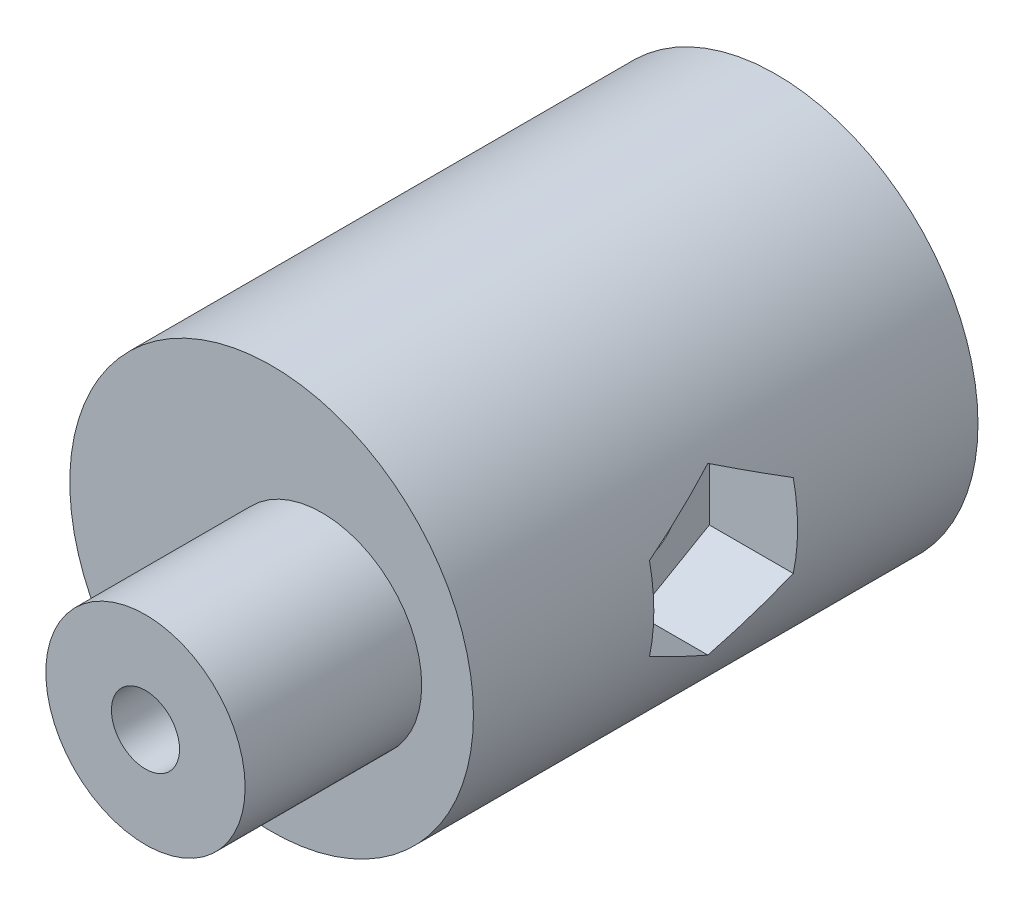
ISO-10303-21;
HEADER;
FILE_DESCRIPTION(('STEP AP214'),'2;1');
FILE_NAME('part.step','',(''),(''),'','','');
FILE_SCHEMA(('AUTOMOTIVE_DESIGN { 1 0 10303 214 1 1 1 1 }'));
ENDSEC;
DATA;
#1=APPLICATION_CONTEXT('core data for automotive mechanical design processes');
#2=APPLICATION_PROTOCOL_DEFINITION('international standard','automotive_design',2000,#1);
#3=PRODUCT_CONTEXT('',#1,'mechanical');
#4=PRODUCT('Part','Part','',(#3));
#5=PRODUCT_RELATED_PRODUCT_CATEGORY('part','',(#4));
#6=PRODUCT_DEFINITION_FORMATION('','',#4);
#7=PRODUCT_DEFINITION_CONTEXT('part definition',#1,'design');
#8=PRODUCT_DEFINITION('design','',#6,#7);
#9=PRODUCT_DEFINITION_SHAPE('','',#8);
#10=(LENGTH_UNIT() NAMED_UNIT(*) SI_UNIT(.MILLI.,.METRE.));
#11=(NAMED_UNIT(*) PLANE_ANGLE_UNIT() SI_UNIT($,.RADIAN.));
#12=(NAMED_UNIT(*) SI_UNIT($,.STERADIAN.) SOLID_ANGLE_UNIT());
#13=UNCERTAINTY_MEASURE_WITH_UNIT(LENGTH_MEASURE(1.E-05),#10,'distance_accuracy_value','');
#14=(GEOMETRIC_REPRESENTATION_CONTEXT(3) GLOBAL_UNCERTAINTY_ASSIGNED_CONTEXT((#13)) GLOBAL_UNIT_ASSIGNED_CONTEXT((#10,
#11,#12)) REPRESENTATION_CONTEXT('',''));
#15=CARTESIAN_POINT('',(0.,0.,0.));
#16=DIRECTION('',(0.,0.,1.));
#17=DIRECTION('',(1.,0.,0.));
#18=AXIS2_PLACEMENT_3D('',#15,#16,#17);
#19=CARTESIAN_POINT('',(2.,0.,21.));
#20=DIRECTION('',(0.,0.,1.));
#21=DIRECTION('',(1.,0.,0.));
#22=AXIS2_PLACEMENT_3D('',#19,#20,#21);
#23=PLANE('',#22);
#24=CARTESIAN_POINT('',(2.,0.,21.));
#25=DIRECTION('',(0.,0.,1.));
#26=DIRECTION('',(1.,0.,0.));
#27=AXIS2_PLACEMENT_3D('',#24,#25,#26);
#28=CIRCLE('',#27,1.35);
#29=CARTESIAN_POINT('',(3.35,0.,21.));
#30=VERTEX_POINT('',#29);
#31=EDGE_CURVE('E10',#30,#30,#28,.T.);
#32=ORIENTED_EDGE('',*,*,#31,.T.);
#33=EDGE_LOOP('',(#32));
#34=FACE_BOUND('',#33,.T.);
#35=ADVANCED_FACE('F16',(#34),#23,.T.);
#36=CARTESIAN_POINT('',(2.,0.,21.));
#37=DIRECTION('',(0.,0.,-1.));
#38=DIRECTION('',(1.,0.,0.));
#39=AXIS2_PLACEMENT_3D('',#36,#37,#38);
#40=CYLINDRICAL_SURFACE('',#39,1.35);
#41=CARTESIAN_POINT('',(2.,0.,27.));
#42=DIRECTION('',(0.,0.,1.));
#43=DIRECTION('',(1.,0.,0.));
#44=AXIS2_PLACEMENT_3D('',#41,#42,#43);
#45=CIRCLE('',#44,1.35);
#46=CARTESIAN_POINT('',(3.35,0.,27.));
#47=VERTEX_POINT('',#46);
#48=EDGE_CURVE('E30',#47,#47,#45,.T.);
#49=ORIENTED_EDGE('',*,*,#48,.T.);
#50=EDGE_LOOP('',(#49));
#51=FACE_BOUND('',#50,.T.);
#52=ORIENTED_EDGE('',*,*,#31,.F.);
#53=EDGE_LOOP('',(#52));
#54=FACE_BOUND('',#53,.T.);
#55=ADVANCED_FACE('F202',(#51,#54),#40,.F.);
#56=CARTESIAN_POINT('',(0.,0.,17.));
#57=DIRECTION('',(0.,0.,1.));
#58=DIRECTION('',(1.,0.,0.));
#59=AXIS2_PLACEMENT_3D('',#56,#57,#58);
#60=PLANE('',#59);
#61=CARTESIAN_POINT('',(0.,0.,17.));
#62=DIRECTION('',(0.,0.,1.));
#63=DIRECTION('',(1.,0.,0.));
#64=AXIS2_PLACEMENT_3D('',#61,#62,#63);
#65=CIRCLE('',#64,2.6);
#66=CARTESIAN_POINT('',(2.6,0.,17.));
#67=VERTEX_POINT('',#66);
#68=EDGE_CURVE('E157',#67,#67,#65,.T.);
#69=ORIENTED_EDGE('',*,*,#68,.F.);
#70=EDGE_LOOP('',(#69));
#71=FACE_BOUND('',#70,.T.);
#72=ADVANCED_FACE('F200',(#71),#60,.F.);
#73=CARTESIAN_POINT('',(2.,0.,27.));
#74=DIRECTION('',(0.,0.,1.));
#75=DIRECTION('',(1.,0.,0.));
#76=AXIS2_PLACEMENT_3D('',#73,#74,#75);
#77=PLANE('',#76);
#78=ORIENTED_EDGE('',*,*,#48,.F.);
#79=EDGE_LOOP('',(#78));
#80=FACE_BOUND('',#79,.T.);
#81=CARTESIAN_POINT('',(2.,0.,27.));
#82=DIRECTION('',(0.,0.,1.));
#83=DIRECTION('',(1.,0.,0.));
#84=AXIS2_PLACEMENT_3D('',#81,#82,#83);
#85=CIRCLE('',#84,3.95);
#86=CARTESIAN_POINT('',(5.95,0.,27.));
#87=VERTEX_POINT('',#86);
#88=EDGE_CURVE('E158',#87,#87,#85,.T.);
#89=ORIENTED_EDGE('',*,*,#88,.T.);
#90=EDGE_LOOP('',(#89));
#91=FACE_BOUND('',#90,.T.);
#92=ADVANCED_FACE('F190',(#80,#91),#77,.T.);
#93=CARTESIAN_POINT('',(2.,0.,10.));
#94=DIRECTION('',(-1.,0.,0.));
#95=DIRECTION('',(0.,1.,0.));
#96=AXIS2_PLACEMENT_3D('',#93,#94,#95);
#97=CYLINDRICAL_SURFACE('',#96,1.65);
#98=CARTESIAN_POINT('',(4.5,0.,10.));
#99=DIRECTION('',(-1.,0.,0.));
#100=DIRECTION('',(0.,1.,0.));
#101=AXIS2_PLACEMENT_3D('',#98,#99,#100);
#102=CIRCLE('',#101,1.65);
#103=CARTESIAN_POINT('',(4.5,1.65,10.));
#104=VERTEX_POINT('',#103);
#105=EDGE_CURVE('E152',#104,#104,#102,.T.);
#106=ORIENTED_EDGE('',*,*,#105,.F.);
#107=EDGE_LOOP('',(#106));
#108=FACE_BOUND('',#107,.T.);
#109=CARTESIAN_POINT('',(2.009353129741,1.65,10.));
#110=CARTESIAN_POINT('',(2.009353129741,1.65,10.08165958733));
#111=CARTESIAN_POINT('',(2.013335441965,1.645150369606,10.163213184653));
#112=CARTESIAN_POINT('',(2.021280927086,1.635474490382,10.244315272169));
#113=CARTESIAN_POINT('',(2.032997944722,1.621026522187,10.324609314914));
#114=CARTESIAN_POINT('',(2.048121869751,1.601898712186,10.403702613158));
#115=CARTESIAN_POINT('',(2.085298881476,1.553229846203,10.563348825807));
#116=CARTESIAN_POINT('',(2.107730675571,1.52310869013,10.643736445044));
#117=CARTESIAN_POINT('',(2.132953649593,1.48803399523,10.722159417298));
#118=CARTESIAN_POINT('',(2.160425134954,1.448069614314,10.798425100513));
#119=CARTESIAN_POINT('',(2.189577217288,1.403256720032,10.872296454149));
#120=CARTESIAN_POINT('',(2.253796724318,1.297942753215,11.023391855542));
#121=CARTESIAN_POINT('',(2.289183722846,1.236138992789,11.099997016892));
#122=CARTESIAN_POINT('',(2.325252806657,1.168153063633,11.173041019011));
#123=CARTESIAN_POINT('',(2.361250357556,1.093834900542,11.242131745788));
#124=CARTESIAN_POINT('',(2.396366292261,1.013010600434,11.306703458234));
#125=CARTESIAN_POINT('',(2.443664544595,0.888844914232,11.390833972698));
#126=CARTESIAN_POINT('',(2.457326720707,0.850980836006,11.414763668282));
#127=CARTESIAN_POINT('',(2.47060067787,0.811948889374,11.437693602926));
#128=CARTESIAN_POINT('',(2.483411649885,0.771756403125,11.459551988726));
#129=CARTESIAN_POINT('',(2.495683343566,0.730414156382,11.48026321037));
#130=CARTESIAN_POINT('',(2.535196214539,0.586400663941,11.54632239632));
#131=CARTESIAN_POINT('',(2.559723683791,0.477668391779,11.586213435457));
#132=CARTESIAN_POINT('',(2.579414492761,0.363050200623,11.617561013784));
#133=CARTESIAN_POINT('',(2.593074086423,0.244095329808,11.639086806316));
#134=CARTESIAN_POINT('',(2.6,0.122497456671,11.65));
#135=CARTESIAN_POINT('',(2.6,0.,11.65));
#136=B_SPLINE_CURVE_WITH_KNOTS('',6,(#109,#110,#111,#112,#113,#114,#115,#116,#117,#118,#119,
#120,#121,#122,#123,#124,#125,#126,#127,#128,#129,#130,#131,#132,#133,#134,#135),.UNSPECIFIED.,
.F.,.F.,(7,5,5,5,5,7),(0.,0.202150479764,0.41671109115,0.65752708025,0.75854184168,1.),.UNSPECIFIED.);
#137=CARTESIAN_POINT('',(2.009353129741,1.65,10.));
#138=VERTEX_POINT('',#137);
#139=CARTESIAN_POINT('',(2.6,0.,11.65));
#140=VERTEX_POINT('',#139);
#141=EDGE_CURVE('E44',#138,#140,#136,.T.);
#142=ORIENTED_EDGE('',*,*,#141,.F.);
#143=CARTESIAN_POINT('',(2.6,0.,8.35));
#144=CARTESIAN_POINT('',(2.6,0.121692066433,8.35));
#145=CARTESIAN_POINT('',(2.593164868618,0.242519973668,8.360770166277));
#146=CARTESIAN_POINT('',(2.579678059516,0.360762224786,8.38202361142));
#147=CARTESIAN_POINT('',(2.560224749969,0.474744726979,8.412988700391));
#148=CARTESIAN_POINT('',(2.535974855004,0.582933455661,8.452411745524));
#149=CARTESIAN_POINT('',(2.496672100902,0.727061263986,8.518069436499));
#150=CARTESIAN_POINT('',(2.484301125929,0.768936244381,8.538932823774));
#151=CARTESIAN_POINT('',(2.471374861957,0.809636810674,8.560972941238));
#152=CARTESIAN_POINT('',(2.457972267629,0.849151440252,8.584111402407));
#153=CARTESIAN_POINT('',(2.444170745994,0.887472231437,8.608273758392));
#154=CARTESIAN_POINT('',(2.396690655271,1.012260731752,8.692700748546));
#155=CARTESIAN_POINT('',(2.361528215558,1.093256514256,8.757336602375));
#156=CARTESIAN_POINT('',(2.325476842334,1.167725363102,8.826508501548));
#157=CARTESIAN_POINT('',(2.289350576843,1.235842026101,8.899647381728));
#158=CARTESIAN_POINT('',(2.253906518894,1.29775748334,8.976359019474));
#159=CARTESIAN_POINT('',(2.189594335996,1.40323328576,9.127655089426));
#160=CARTESIAN_POINT('',(2.160405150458,1.448103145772,9.20161729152));
#161=CARTESIAN_POINT('',(2.13290073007,1.488112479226,9.277979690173));
#162=CARTESIAN_POINT('',(2.10765112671,1.523219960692,9.356504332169));
#163=CARTESIAN_POINT('',(2.085200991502,1.553361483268,9.436997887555));
#164=CARTESIAN_POINT('',(2.048047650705,1.60199257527,9.596685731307));
#165=CARTESIAN_POINT('',(2.032951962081,1.62108322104,9.675705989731));
#166=CARTESIAN_POINT('',(2.021257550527,1.635502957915,9.755923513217));
#167=CARTESIAN_POINT('',(2.013327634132,1.645159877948,9.836946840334));
#168=CARTESIAN_POINT('',(2.009353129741,1.65,9.918420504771));
#169=CARTESIAN_POINT('',(2.009353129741,1.65,10.));
#170=B_SPLINE_CURVE_WITH_KNOTS('',6,(#143,#144,#145,#146,#147,#148,#149,#150,#151,#152,#153,
#154,#155,#156,#157,#158,#159,#160,#161,#162,#163,#164,#165,#166,#167,#168,#169),.UNSPECIFIED.,
.F.,.F.,(7,5,5,5,5,7),(0.,0.239916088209,0.342045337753,0.583225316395,0.798049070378,1.),.UNSPECIFIED.);
#171=CARTESIAN_POINT('',(2.6,0.,8.35));
#172=VERTEX_POINT('',#171);
#173=EDGE_CURVE('E19',#172,#138,#170,.T.);
#174=ORIENTED_EDGE('',*,*,#173,.F.);
#175=CARTESIAN_POINT('',(2.6,0.,11.65));
#176=CARTESIAN_POINT('',(2.6,-0.121692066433,11.65));
#177=CARTESIAN_POINT('',(2.593164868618,-0.242519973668,11.639229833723));
#178=CARTESIAN_POINT('',(2.579678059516,-0.360762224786,11.617976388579));
#179=CARTESIAN_POINT('',(2.560224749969,-0.474744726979,11.587011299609));
#180=CARTESIAN_POINT('',(2.535974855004,-0.582933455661,11.547588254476));
#181=CARTESIAN_POINT('',(2.496672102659,-0.727061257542,11.481930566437));
#182=CARTESIAN_POINT('',(2.484301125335,-0.768936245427,11.461067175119));
#183=CARTESIAN_POINT('',(2.471374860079,-0.80963681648,11.439027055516));
#184=CARTESIAN_POINT('',(2.457972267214,-0.849151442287,11.415888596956));
#185=CARTESIAN_POINT('',(2.444170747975,-0.887472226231,11.39172624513));
#186=CARTESIAN_POINT('',(2.396690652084,-1.012260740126,11.307299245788));
#187=CARTESIAN_POINT('',(2.361528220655,-1.093256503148,11.242663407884));
#188=CARTESIAN_POINT('',(2.325476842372,-1.167725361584,11.173491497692));
#189=CARTESIAN_POINT('',(2.289350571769,-1.23584203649,11.100352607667));
#190=CARTESIAN_POINT('',(2.25390652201,-1.297757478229,11.023640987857));
#191=CARTESIAN_POINT('',(2.189594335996,-1.40323328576,10.872344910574));
#192=CARTESIAN_POINT('',(2.160405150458,-1.448103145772,10.79838270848));
#193=CARTESIAN_POINT('',(2.13290073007,-1.488112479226,10.722020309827));
#194=CARTESIAN_POINT('',(2.10765112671,-1.523219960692,10.643495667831));
#195=CARTESIAN_POINT('',(2.085200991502,-1.553361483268,10.563002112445));
#196=CARTESIAN_POINT('',(2.048047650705,-1.60199257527,10.403314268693));
#197=CARTESIAN_POINT('',(2.032951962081,-1.62108322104,10.324294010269));
#198=CARTESIAN_POINT('',(2.021257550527,-1.635502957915,10.244076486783));
#199=CARTESIAN_POINT('',(2.013327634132,-1.645159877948,10.163053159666));
#200=CARTESIAN_POINT('',(2.009353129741,-1.65,10.081579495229));
#201=CARTESIAN_POINT('',(2.009353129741,-1.65,9.91834041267));
#202=CARTESIAN_POINT('',(2.013335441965,-1.645150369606,9.836786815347));
#203=CARTESIAN_POINT('',(2.021280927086,-1.635474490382,9.755684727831));
#204=CARTESIAN_POINT('',(2.032997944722,-1.621026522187,9.675390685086));
#205=CARTESIAN_POINT('',(2.048121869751,-1.601898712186,9.596297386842));
#206=CARTESIAN_POINT('',(2.085298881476,-1.553229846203,9.436651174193));
#207=CARTESIAN_POINT('',(2.107730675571,-1.52310869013,9.356263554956));
#208=CARTESIAN_POINT('',(2.132953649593,-1.48803399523,9.277840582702));
#209=CARTESIAN_POINT('',(2.160425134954,-1.448069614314,9.201574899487));
#210=CARTESIAN_POINT('',(2.189577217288,-1.403256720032,9.127703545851));
#211=CARTESIAN_POINT('',(2.253796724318,-1.297942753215,8.976608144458));
#212=CARTESIAN_POINT('',(2.289183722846,-1.236138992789,8.900002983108));
#213=CARTESIAN_POINT('',(2.325252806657,-1.168153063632,8.826958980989));
#214=CARTESIAN_POINT('',(2.361250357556,-1.093834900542,8.757868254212));
#215=CARTESIAN_POINT('',(2.396366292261,-1.013010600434,8.693296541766));
#216=CARTESIAN_POINT('',(2.443664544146,-0.888844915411,8.609166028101));
#217=CARTESIAN_POINT('',(2.457326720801,-0.850980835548,8.585236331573));
#218=CARTESIAN_POINT('',(2.470600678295,-0.811948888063,8.562306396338));
#219=CARTESIAN_POINT('',(2.48341165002,-0.771756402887,8.540448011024));
#220=CARTESIAN_POINT('',(2.495683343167,-0.730414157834,8.519736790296));
#221=CARTESIAN_POINT('',(2.535196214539,-0.586400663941,8.45367760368));
#222=CARTESIAN_POINT('',(2.559723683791,-0.477668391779,8.413786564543));
#223=CARTESIAN_POINT('',(2.579414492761,-0.363050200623,8.382438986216));
#224=CARTESIAN_POINT('',(2.593074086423,-0.244095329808,8.360913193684));
#225=CARTESIAN_POINT('',(2.6,-0.122497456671,8.35));
#226=CARTESIAN_POINT('',(2.6,0.,8.35));
#227=B_SPLINE_CURVE_WITH_KNOTS('',6,(#175,#176,#177,#178,#179,#180,#181,#182,#183,#184,#185,
#186,#187,#188,#189,#190,#191,#192,#193,#194,#195,#196,#197,#198,#199,#200,#201,#202,#203,#204,
#205,#206,#207,#208,#209,#210,#211,#212,#213,#214,#215,#216,#217,#218,#219,#220,#221,#222,#223,
#224,#225,#226),.UNSPECIFIED.,.F.,.F.,(7,5,5,5,5,5,5,5,5,5,7),(0.,0.119958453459,0.171023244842,
0.291613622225,0.399025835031,0.500001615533,0.601076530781,0.70835649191,0.828764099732,
0.879271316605,1.),.UNSPECIFIED.);
#228=EDGE_CURVE('E37',#140,#172,#227,.T.);
#229=ORIENTED_EDGE('',*,*,#228,.F.);
#230=EDGE_LOOP('',(#142,#174,#229));
#231=FACE_BOUND('',#230,.T.);
#232=ADVANCED_FACE('F185',(#108,#231),#97,.F.);
#233=CARTESIAN_POINT('',(0.,0.,0.));
#234=DIRECTION('',(0.,0.,-1.));
#235=DIRECTION('',(1.,0.,0.));
#236=AXIS2_PLACEMENT_3D('',#233,#234,#235);
#237=CYLINDRICAL_SURFACE('',#236,2.6);
#238=ORIENTED_EDGE('',*,*,#228,.T.);
#239=ORIENTED_EDGE('',*,*,#173,.T.);
#240=ORIENTED_EDGE('',*,*,#141,.T.);
#241=EDGE_LOOP('',(#238,#239,#240));
#242=FACE_BOUND('',#241,.T.);
#243=ORIENTED_EDGE('',*,*,#68,.T.);
#244=EDGE_LOOP('',(#243));
#245=FACE_BOUND('',#244,.T.);
#246=CARTESIAN_POINT('',(0.,0.,0.));
#247=DIRECTION('',(0.,0.,1.));
#248=DIRECTION('',(1.,0.,0.));
#249=AXIS2_PLACEMENT_3D('',#246,#247,#248);
#250=CIRCLE('',#249,2.6);
#251=CARTESIAN_POINT('',(2.6,0.,0.));
#252=VERTEX_POINT('',#251);
#253=EDGE_CURVE('E147',#252,#252,#250,.T.);
#254=ORIENTED_EDGE('',*,*,#253,.F.);
#255=EDGE_LOOP('',(#254));
#256=FACE_BOUND('',#255,.T.);
#257=ADVANCED_FACE('F184',(#242,#245,#256),#237,.F.);
#258=CARTESIAN_POINT('',(2.,0.,20.));
#259=DIRECTION('',(0.,0.,-1.));
#260=DIRECTION('',(1.,0.,0.));
#261=AXIS2_PLACEMENT_3D('',#258,#259,#260);
#262=CYLINDRICAL_SURFACE('',#261,3.95);
#263=ORIENTED_EDGE('',*,*,#88,.F.);
#264=EDGE_LOOP('',(#263));
#265=FACE_BOUND('',#264,.T.);
#266=CARTESIAN_POINT('',(2.,0.,20.));
#267=DIRECTION('',(0.,0.,1.));
#268=DIRECTION('',(1.,0.,0.));
#269=AXIS2_PLACEMENT_3D('',#266,#267,#268);
#270=CIRCLE('',#269,3.95);
#271=CARTESIAN_POINT('',(5.95,0.,20.));
#272=VERTEX_POINT('',#271);
#273=EDGE_CURVE('E137',#272,#272,#270,.T.);
#274=ORIENTED_EDGE('',*,*,#273,.T.);
#275=EDGE_LOOP('',(#274));
#276=FACE_BOUND('',#275,.T.);
#277=ADVANCED_FACE('F194',(#265,#276),#262,.T.);
#278=CARTESIAN_POINT('',(4.5,0.,10.));
#279=DIRECTION('',(1.,0.,0.));
#280=DIRECTION('',(0.,1.,0.));
#281=AXIS2_PLACEMENT_3D('',#278,#279,#280);
#282=PLANE('',#281);
#283=ORIENTED_EDGE('',*,*,#105,.T.);
#284=EDGE_LOOP('',(#283));
#285=FACE_BOUND('',#284,.T.);
#286=DIRECTION('',(0.,-0.50000000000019,0.866025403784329));
#287=VECTOR('',#286,1.);
#288=CARTESIAN_POINT('',(4.5,3.290896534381,10.));
#289=LINE('',#288,#287);
#290=CARTESIAN_POINT('',(4.5,3.290896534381,10.));
#291=VERTEX_POINT('',#290);
#292=CARTESIAN_POINT('',(4.5,1.64544826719,12.85));
#293=VERTEX_POINT('',#292);
#294=EDGE_CURVE('E110',#291,#293,#289,.T.);
#295=ORIENTED_EDGE('',*,*,#294,.T.);
#296=DIRECTION('',(0.,-1.,0.));
#297=VECTOR('',#296,1.);
#298=CARTESIAN_POINT('',(4.5,1.64544826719,12.85));
#299=LINE('',#298,#297);
#300=CARTESIAN_POINT('',(4.5,-1.64544826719,12.85));
#301=VERTEX_POINT('',#300);
#302=EDGE_CURVE('E97',#293,#301,#299,.T.);
#303=ORIENTED_EDGE('',*,*,#302,.T.);
#304=DIRECTION('',(0.,-0.50000000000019,-0.866025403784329));
#305=VECTOR('',#304,1.);
#306=CARTESIAN_POINT('',(4.5,-1.64544826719,12.85));
#307=LINE('',#306,#305);
#308=CARTESIAN_POINT('',(4.5,-3.290896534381,10.));
#309=VERTEX_POINT('',#308);
#310=EDGE_CURVE('E102',#301,#309,#307,.T.);
#311=ORIENTED_EDGE('',*,*,#310,.T.);
#312=DIRECTION('',(0.,0.50000000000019,-0.866025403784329));
#313=VECTOR('',#312,1.);
#314=CARTESIAN_POINT('',(4.5,-3.290896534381,10.));
#315=LINE('',#314,#313);
#316=CARTESIAN_POINT('',(4.5,-1.64544826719,7.15));
#317=VERTEX_POINT('',#316);
#318=EDGE_CURVE('E129',#309,#317,#315,.T.);
#319=ORIENTED_EDGE('',*,*,#318,.T.);
#320=DIRECTION('',(0.,1.,0.));
#321=VECTOR('',#320,1.);
#322=CARTESIAN_POINT('',(4.5,-1.64544826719,7.15));
#323=LINE('',#322,#321);
#324=CARTESIAN_POINT('',(4.5,1.64544826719,7.15));
#325=VERTEX_POINT('',#324);
#326=EDGE_CURVE('E242',#317,#325,#323,.T.);
#327=ORIENTED_EDGE('',*,*,#326,.T.);
#328=DIRECTION('',(0.,0.50000000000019,0.866025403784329));
#329=VECTOR('',#328,1.);
#330=CARTESIAN_POINT('',(4.5,1.64544826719,7.15));
#331=LINE('',#330,#329);
#332=EDGE_CURVE('E144',#325,#291,#331,.T.);
#333=ORIENTED_EDGE('',*,*,#332,.T.);
#334=EDGE_LOOP('',(#295,#303,#311,#319,#327,#333));
#335=FACE_BOUND('',#334,.T.);
#336=ADVANCED_FACE('F105',(#285,#335),#282,.T.);
#337=CARTESIAN_POINT('',(0.,0.,0.));
#338=DIRECTION('',(0.,0.,1.));
#339=DIRECTION('',(1.,0.,0.));
#340=AXIS2_PLACEMENT_3D('',#337,#338,#339);
#341=PLANE('',#340);
#342=ORIENTED_EDGE('',*,*,#253,.T.);
#343=EDGE_LOOP('',(#342));
#344=FACE_BOUND('',#343,.T.);
#345=CARTESIAN_POINT('',(0.,0.,0.));
#346=DIRECTION('',(0.,0.,1.));
#347=DIRECTION('',(1.,0.,0.));
#348=AXIS2_PLACEMENT_3D('',#345,#346,#347);
#349=CIRCLE('',#348,8.);
#350=CARTESIAN_POINT('',(8.,0.,0.));
#351=VERTEX_POINT('',#350);
#352=EDGE_CURVE('E236',#351,#351,#349,.T.);
#353=ORIENTED_EDGE('',*,*,#352,.F.);
#354=EDGE_LOOP('',(#353));
#355=FACE_BOUND('',#354,.T.);
#356=ADVANCED_FACE('F222',(#344,#355),#341,.F.);
#357=CARTESIAN_POINT('',(4.5,1.64544826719,7.15));
#358=DIRECTION('',(0.,-0.866025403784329,0.50000000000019));
#359=DIRECTION('',(-1.,0.,0.));
#360=AXIS2_PLACEMENT_3D('',#357,#358,#359);
#361=PLANE('',#360);
#362=ORIENTED_EDGE('',*,*,#332,.F.);
#363=DIRECTION('',(1.,0.,0.));
#364=VECTOR('',#363,1.);
#365=CARTESIAN_POINT('',(4.5,1.64544826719,7.15));
#366=LINE('',#365,#364);
#367=CARTESIAN_POINT('',(7.828952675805,1.64544826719,7.15));
#368=VERTEX_POINT('',#367);
#369=EDGE_CURVE('E264',#325,#368,#366,.T.);
#370=ORIENTED_EDGE('',*,*,#369,.T.);
#371=CARTESIAN_POINT('',(0.,0.,4.3));
#372=DIRECTION('',(0.,-0.866025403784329,0.50000000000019));
#373=DIRECTION('',(0.,-0.50000000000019,-0.866025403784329));
#374=AXIS2_PLACEMENT_3D('',#371,#372,#373);
#375=ELLIPSE('',#374,16.,8.);
#376=CARTESIAN_POINT('',(7.291776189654,3.290896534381,10.));
#377=VERTEX_POINT('',#376);
#378=EDGE_CURVE('E244',#368,#377,#375,.T.);
#379=ORIENTED_EDGE('',*,*,#378,.T.);
#380=DIRECTION('',(1.,0.,0.));
#381=VECTOR('',#380,1.);
#382=CARTESIAN_POINT('',(4.5,3.290896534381,10.));
#383=LINE('',#382,#381);
#384=EDGE_CURVE('E145',#291,#377,#383,.T.);
#385=ORIENTED_EDGE('',*,*,#384,.F.);
#386=EDGE_LOOP('',(#362,#370,#379,#385));
#387=FACE_BOUND('',#386,.T.);
#388=ADVANCED_FACE('F226',(#387),#361,.T.);
#389=CARTESIAN_POINT('',(4.5,3.290896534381,10.));
#390=DIRECTION('',(0.,-0.866025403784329,-0.50000000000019));
#391=DIRECTION('',(0.,0.50000000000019,-0.866025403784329));
#392=AXIS2_PLACEMENT_3D('',#389,#390,#391);
#393=PLANE('',#392);
#394=ORIENTED_EDGE('',*,*,#294,.F.);
#395=ORIENTED_EDGE('',*,*,#384,.T.);
#396=CARTESIAN_POINT('',(0.,0.,15.7));
#397=DIRECTION('',(0.,-0.866025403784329,-0.50000000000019));
#398=DIRECTION('',(0.,0.50000000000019,-0.866025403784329));
#399=AXIS2_PLACEMENT_3D('',#396,#397,#398);
#400=ELLIPSE('',#399,16.,8.);
#401=CARTESIAN_POINT('',(7.828952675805,1.64544826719,12.85));
#402=VERTEX_POINT('',#401);
#403=EDGE_CURVE('E252',#377,#402,#400,.T.);
#404=ORIENTED_EDGE('',*,*,#403,.T.);
#405=DIRECTION('',(1.,0.,0.));
#406=VECTOR('',#405,1.);
#407=CARTESIAN_POINT('',(4.5,1.64544826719,12.85));
#408=LINE('',#407,#406);
#409=EDGE_CURVE('E115',#293,#402,#408,.T.);
#410=ORIENTED_EDGE('',*,*,#409,.F.);
#411=EDGE_LOOP('',(#394,#395,#404,#410));
#412=FACE_BOUND('',#411,.T.);
#413=ADVANCED_FACE('F225',(#412),#393,.T.);
#414=CARTESIAN_POINT('',(0.,0.,20.));
#415=DIRECTION('',(0.,0.,1.));
#416=DIRECTION('',(1.,0.,0.));
#417=AXIS2_PLACEMENT_3D('',#414,#415,#416);
#418=PLANE('',#417);
#419=ORIENTED_EDGE('',*,*,#273,.F.);
#420=EDGE_LOOP('',(#419));
#421=FACE_BOUND('',#420,.T.);
#422=CARTESIAN_POINT('',(0.,0.,20.));
#423=DIRECTION('',(0.,0.,1.));
#424=DIRECTION('',(1.,0.,0.));
#425=AXIS2_PLACEMENT_3D('',#422,#423,#424);
#426=CIRCLE('',#425,8.);
#427=CARTESIAN_POINT('',(8.,0.,20.));
#428=VERTEX_POINT('',#427);
#429=EDGE_CURVE('E256',#428,#428,#426,.T.);
#430=ORIENTED_EDGE('',*,*,#429,.T.);
#431=EDGE_LOOP('',(#430));
#432=FACE_BOUND('',#431,.T.);
#433=ADVANCED_FACE('F217',(#421,#432),#418,.T.);
#434=CARTESIAN_POINT('',(4.5,1.64544826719,12.85));
#435=DIRECTION('',(0.,0.,-1.));
#436=DIRECTION('',(0.,-1.,0.));
#437=AXIS2_PLACEMENT_3D('',#434,#435,#436);
#438=PLANE('',#437);
#439=ORIENTED_EDGE('',*,*,#302,.F.);
#440=ORIENTED_EDGE('',*,*,#409,.T.);
#441=CARTESIAN_POINT('',(0.,0.,12.85));
#442=DIRECTION('',(0.,0.,-1.));
#443=DIRECTION('',(1.,0.,0.));
#444=AXIS2_PLACEMENT_3D('',#441,#442,#443);
#445=CIRCLE('',#444,8.);
#446=CARTESIAN_POINT('',(7.828952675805,-1.64544826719,12.85));
#447=VERTEX_POINT('',#446);
#448=EDGE_CURVE('E120',#402,#447,#445,.T.);
#449=ORIENTED_EDGE('',*,*,#448,.T.);
#450=DIRECTION('',(1.,0.,0.));
#451=VECTOR('',#450,1.);
#452=CARTESIAN_POINT('',(4.5,-1.64544826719,12.85));
#453=LINE('',#452,#451);
#454=EDGE_CURVE('E112',#301,#447,#453,.T.);
#455=ORIENTED_EDGE('',*,*,#454,.F.);
#456=EDGE_LOOP('',(#439,#440,#449,#455));
#457=FACE_BOUND('',#456,.T.);
#458=ADVANCED_FACE('F117',(#457),#438,.T.);
#459=CARTESIAN_POINT('',(4.5,-1.64544826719,12.85));
#460=DIRECTION('',(0.,0.866025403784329,-0.50000000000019));
#461=DIRECTION('',(-1.,0.,0.));
#462=AXIS2_PLACEMENT_3D('',#459,#460,#461);
#463=PLANE('',#462);
#464=ORIENTED_EDGE('',*,*,#310,.F.);
#465=ORIENTED_EDGE('',*,*,#454,.T.);
#466=CARTESIAN_POINT('',(0.,0.,15.7));
#467=DIRECTION('',(0.,0.866025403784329,-0.50000000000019));
#468=DIRECTION('',(0.,-0.50000000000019,-0.866025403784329));
#469=AXIS2_PLACEMENT_3D('',#466,#467,#468);
#470=ELLIPSE('',#469,16.,8.);
#471=CARTESIAN_POINT('',(7.291776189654,-3.290896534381,10.));
#472=VERTEX_POINT('',#471);
#473=EDGE_CURVE('E412',#447,#472,#470,.T.);
#474=ORIENTED_EDGE('',*,*,#473,.T.);
#475=DIRECTION('',(1.,0.,0.));
#476=VECTOR('',#475,1.);
#477=CARTESIAN_POINT('',(4.5,-3.290896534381,10.));
#478=LINE('',#477,#476);
#479=EDGE_CURVE('E123',#309,#472,#478,.T.);
#480=ORIENTED_EDGE('',*,*,#479,.F.);
#481=EDGE_LOOP('',(#464,#465,#474,#480));
#482=FACE_BOUND('',#481,.T.);
#483=ADVANCED_FACE('F124',(#482),#463,.T.);
#484=CARTESIAN_POINT('',(4.5,-3.290896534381,10.));
#485=DIRECTION('',(0.,0.866025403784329,0.50000000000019));
#486=DIRECTION('',(1.,0.,0.));
#487=AXIS2_PLACEMENT_3D('',#484,#485,#486);
#488=PLANE('',#487);
#489=ORIENTED_EDGE('',*,*,#318,.F.);
#490=ORIENTED_EDGE('',*,*,#479,.T.);
#491=CARTESIAN_POINT('',(0.,0.,4.3));
#492=DIRECTION('',(0.,0.866025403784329,0.50000000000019));
#493=DIRECTION('',(0.,0.50000000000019,-0.866025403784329));
#494=AXIS2_PLACEMENT_3D('',#491,#492,#493);
#495=ELLIPSE('',#494,16.,8.);
#496=CARTESIAN_POINT('',(7.828952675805,-1.64544826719,7.15));
#497=VERTEX_POINT('',#496);
#498=EDGE_CURVE('E276',#472,#497,#495,.T.);
#499=ORIENTED_EDGE('',*,*,#498,.T.);
#500=DIRECTION('',(1.,0.,0.));
#501=VECTOR('',#500,1.);
#502=CARTESIAN_POINT('',(4.5,-1.64544826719,7.15));
#503=LINE('',#502,#501);
#504=EDGE_CURVE('E249',#317,#497,#503,.T.);
#505=ORIENTED_EDGE('',*,*,#504,.F.);
#506=EDGE_LOOP('',(#489,#490,#499,#505));
#507=FACE_BOUND('',#506,.T.);
#508=ADVANCED_FACE('F278',(#507),#488,.T.);
#509=CARTESIAN_POINT('',(4.5,-1.64544826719,7.15));
#510=DIRECTION('',(0.,0.,1.));
#511=DIRECTION('',(0.,-1.,0.));
#512=AXIS2_PLACEMENT_3D('',#509,#510,#511);
#513=PLANE('',#512);
#514=ORIENTED_EDGE('',*,*,#326,.F.);
#515=ORIENTED_EDGE('',*,*,#504,.T.);
#516=CARTESIAN_POINT('',(0.,0.,7.15));
#517=DIRECTION('',(0.,0.,-1.));
#518=DIRECTION('',(1.,0.,0.));
#519=AXIS2_PLACEMENT_3D('',#516,#517,#518);
#520=CIRCLE('',#519,8.);
#521=EDGE_CURVE('E283',#368,#497,#520,.T.);
#522=ORIENTED_EDGE('',*,*,#521,.F.);
#523=ORIENTED_EDGE('',*,*,#369,.F.);
#524=EDGE_LOOP('',(#514,#515,#522,#523));
#525=FACE_BOUND('',#524,.T.);
#526=ADVANCED_FACE('F285',(#525),#513,.T.);
#527=CARTESIAN_POINT('',(0.,0.,0.));
#528=DIRECTION('',(0.,0.,-1.));
#529=DIRECTION('',(1.,0.,0.));
#530=AXIS2_PLACEMENT_3D('',#527,#528,#529);
#531=CYLINDRICAL_SURFACE('',#530,8.);
#532=ORIENTED_EDGE('',*,*,#429,.F.);
#533=EDGE_LOOP('',(#532));
#534=FACE_BOUND('',#533,.T.);
#535=ORIENTED_EDGE('',*,*,#378,.F.);
#536=ORIENTED_EDGE('',*,*,#521,.T.);
#537=ORIENTED_EDGE('',*,*,#498,.F.);
#538=ORIENTED_EDGE('',*,*,#473,.F.);
#539=ORIENTED_EDGE('',*,*,#448,.F.);
#540=ORIENTED_EDGE('',*,*,#403,.F.);
#541=EDGE_LOOP('',(#535,#536,#537,#538,#539,#540));
#542=FACE_BOUND('',#541,.T.);
#543=ORIENTED_EDGE('',*,*,#352,.T.);
#544=EDGE_LOOP('',(#543));
#545=FACE_BOUND('',#544,.T.);
#546=ADVANCED_FACE('F288',(#534,#542,#545),#531,.T.);
#547=CLOSED_SHELL('',(#35,#55,#72,#92,#232,#257,#277,#336,#356,#388,#413,#433,#458,#483,#508,
#526,#546));
#548=MANIFOLD_SOLID_BREP('B1',#547);
#549=ADVANCED_BREP_SHAPE_REPRESENTATION('',(#18,#548),#14);
#550=SHAPE_DEFINITION_REPRESENTATION(#9,#549);
ENDSEC;
END-ISO-10303-21;
